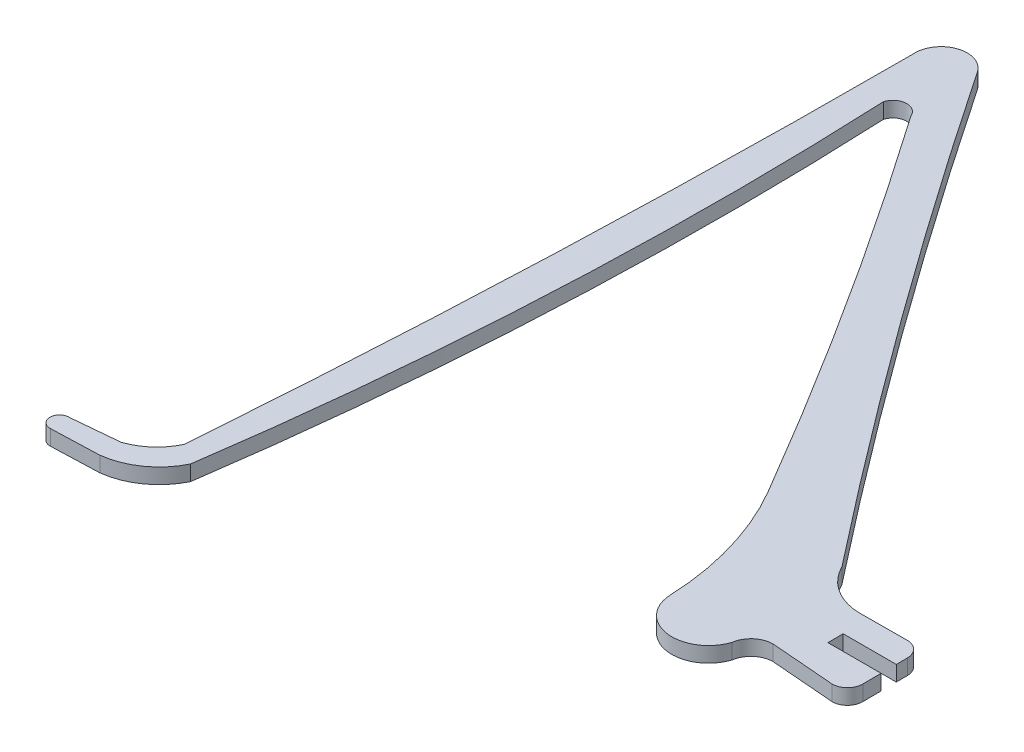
ISO-10303-21;
HEADER;
FILE_DESCRIPTION(('STEP AP214'),'2;1');
FILE_NAME('part.step','',(''),(''),'','','');
FILE_SCHEMA(('AUTOMOTIVE_DESIGN { 1 0 10303 214 1 1 1 1 }'));
ENDSEC;
DATA;
#1=APPLICATION_CONTEXT('core data for automotive mechanical design processes');
#2=APPLICATION_PROTOCOL_DEFINITION('international standard','automotive_design',2000,#1);
#3=PRODUCT_CONTEXT('',#1,'mechanical');
#4=PRODUCT('Part','Part','',(#3));
#5=PRODUCT_RELATED_PRODUCT_CATEGORY('part','',(#4));
#6=PRODUCT_DEFINITION_FORMATION('','',#4);
#7=PRODUCT_DEFINITION_CONTEXT('part definition',#1,'design');
#8=PRODUCT_DEFINITION('design','',#6,#7);
#9=PRODUCT_DEFINITION_SHAPE('','',#8);
#10=(LENGTH_UNIT() NAMED_UNIT(*) SI_UNIT(.MILLI.,.METRE.));
#11=(NAMED_UNIT(*) PLANE_ANGLE_UNIT() SI_UNIT($,.RADIAN.));
#12=(NAMED_UNIT(*) SI_UNIT($,.STERADIAN.) SOLID_ANGLE_UNIT());
#13=UNCERTAINTY_MEASURE_WITH_UNIT(LENGTH_MEASURE(1.E-05),#10,'distance_accuracy_value','');
#14=(GEOMETRIC_REPRESENTATION_CONTEXT(3) GLOBAL_UNCERTAINTY_ASSIGNED_CONTEXT((#13)) GLOBAL_UNIT_ASSIGNED_CONTEXT((#10,
#11,#12)) REPRESENTATION_CONTEXT('',''));
#15=CARTESIAN_POINT('',(0.,0.,0.));
#16=DIRECTION('',(0.,0.,1.));
#17=DIRECTION('',(1.,0.,0.));
#18=AXIS2_PLACEMENT_3D('',#15,#16,#17);
#19=CARTESIAN_POINT('',(-42152.2019871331,3.,-18324.132786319));
#20=DIRECTION('',(0.,-1.,0.));
#21=DIRECTION('',(0.,0.,-1.));
#22=AXIS2_PLACEMENT_3D('',#19,#20,#21);
#23=CYLINDRICAL_SURFACE('',#22,13.2933695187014);
#24=CARTESIAN_POINT('',(-42152.2019871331,0.,-18324.132786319));
#25=DIRECTION('',(0.,1.,0.));
#26=DIRECTION('',(0.,0.,1.));
#27=AXIS2_PLACEMENT_3D('',#24,#25,#26);
#28=CIRCLE('',#27,13.2933695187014);
#29=CARTESIAN_POINT('',(-42150.574219,0.,-18310.939453));
#30=VERTEX_POINT('',#29);
#31=CARTESIAN_POINT('',(-42140.243633,0.,-18318.326631));
#32=VERTEX_POINT('',#31);
#33=EDGE_CURVE('E228',#30,#32,#28,.T.);
#34=ORIENTED_EDGE('',*,*,#33,.T.);
#35=DIRECTION('',(0.,-1.,0.));
#36=VECTOR('',#35,1.);
#37=CARTESIAN_POINT('',(-42140.243633,3.,-18318.326631));
#38=LINE('',#37,#36);
#39=CARTESIAN_POINT('',(-42140.243633,3.,-18318.326631));
#40=VERTEX_POINT('',#39);
#41=EDGE_CURVE('E11',#40,#32,#38,.T.);
#42=ORIENTED_EDGE('',*,*,#41,.F.);
#43=CARTESIAN_POINT('',(-42152.2019871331,3.,-18324.132786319));
#44=DIRECTION('',(0.,1.,0.));
#45=DIRECTION('',(0.,0.,1.));
#46=AXIS2_PLACEMENT_3D('',#43,#44,#45);
#47=CIRCLE('',#46,13.2933695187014);
#48=CARTESIAN_POINT('',(-42150.574219,3.,-18310.939453));
#49=VERTEX_POINT('',#48);
#50=EDGE_CURVE('E274',#49,#40,#47,.T.);
#51=ORIENTED_EDGE('',*,*,#50,.F.);
#52=DIRECTION('',(0.,-1.,0.));
#53=VECTOR('',#52,1.);
#54=CARTESIAN_POINT('',(-42150.574219,3.,-18310.939453));
#55=LINE('',#54,#53);
#56=EDGE_CURVE('E224',#49,#30,#55,.T.);
#57=ORIENTED_EDGE('',*,*,#56,.T.);
#58=EDGE_LOOP('',(#34,#42,#51,#57));
#59=FACE_BOUND('',#58,.T.);
#60=ADVANCED_FACE('F36',(#59),#23,.T.);
#61=CARTESIAN_POINT('',(-42815.5416982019,3.,-18416.5647065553));
#62=DIRECTION('',(0.,-1.,0.));
#63=DIRECTION('',(0.,0.,-1.));
#64=AXIS2_PLACEMENT_3D('',#61,#62,#63);
#65=CYLINDRICAL_SURFACE('',#64,682.406181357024);
#66=CARTESIAN_POINT('',(-42815.5416982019,0.,-18416.5647065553));
#67=DIRECTION('',(0.,1.,0.));
#68=DIRECTION('',(0.,0.,1.));
#69=AXIS2_PLACEMENT_3D('',#66,#67,#68);
#70=CIRCLE('',#69,682.406181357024);
#71=CARTESIAN_POINT('',(-42133.839682,0.,-18447.557568));
#72=VERTEX_POINT('',#71);
#73=EDGE_CURVE('E231',#32,#72,#70,.T.);
#74=ORIENTED_EDGE('',*,*,#73,.T.);
#75=DIRECTION('',(0.,-1.,0.));
#76=VECTOR('',#75,1.);
#77=CARTESIAN_POINT('',(-42133.839682,3.,-18447.557568));
#78=LINE('',#77,#76);
#79=CARTESIAN_POINT('',(-42133.839682,3.,-18447.557568));
#80=VERTEX_POINT('',#79);
#81=EDGE_CURVE('E44',#80,#72,#78,.T.);
#82=ORIENTED_EDGE('',*,*,#81,.F.);
#83=CARTESIAN_POINT('',(-42815.5416982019,3.,-18416.5647065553));
#84=DIRECTION('',(0.,1.,0.));
#85=DIRECTION('',(0.,0.,1.));
#86=AXIS2_PLACEMENT_3D('',#83,#84,#85);
#87=CIRCLE('',#86,682.406181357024);
#88=EDGE_CURVE('E143',#40,#80,#87,.T.);
#89=ORIENTED_EDGE('',*,*,#88,.F.);
#90=ORIENTED_EDGE('',*,*,#41,.T.);
#91=EDGE_LOOP('',(#74,#82,#89,#90));
#92=FACE_BOUND('',#91,.T.);
#93=ADVANCED_FACE('F412',(#92),#65,.T.);
#94=CARTESIAN_POINT('',(-42131.2401209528,3.,-18446.8614757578));
#95=DIRECTION('',(0.,-1.,0.));
#96=DIRECTION('',(0.,0.,-1.));
#97=AXIS2_PLACEMENT_3D('',#94,#95,#96);
#98=CYLINDRICAL_SURFACE('',#97,2.69114511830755);
#99=CARTESIAN_POINT('',(-42131.2401209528,0.,-18446.8614757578));
#100=DIRECTION('',(0.,-1.,0.));
#101=DIRECTION('',(0.,0.,1.));
#102=AXIS2_PLACEMENT_3D('',#99,#100,#101);
#103=CIRCLE('',#102,2.69114511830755);
#104=CARTESIAN_POINT('',(-42128.7660750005,0.,-18447.9204180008));
#105=VERTEX_POINT('',#104);
#106=EDGE_CURVE('E233',#72,#105,#103,.T.);
#107=ORIENTED_EDGE('',*,*,#106,.T.);
#108=DIRECTION('',(0.,-1.,0.));
#109=VECTOR('',#108,1.);
#110=CARTESIAN_POINT('',(-42128.7660750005,3.,-18447.9204180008));
#111=LINE('',#110,#109);
#112=CARTESIAN_POINT('',(-42128.7660750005,3.,-18447.9204180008));
#113=VERTEX_POINT('',#112);
#114=EDGE_CURVE('E329',#113,#105,#111,.T.);
#115=ORIENTED_EDGE('',*,*,#114,.F.);
#116=CARTESIAN_POINT('',(-42131.2401209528,3.,-18446.8614757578));
#117=DIRECTION('',(0.,-1.,0.));
#118=DIRECTION('',(0.,0.,1.));
#119=AXIS2_PLACEMENT_3D('',#116,#117,#118);
#120=CIRCLE('',#119,2.69114511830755);
#121=EDGE_CURVE('E337',#80,#113,#120,.T.);
#122=ORIENTED_EDGE('',*,*,#121,.F.);
#123=ORIENTED_EDGE('',*,*,#81,.T.);
#124=EDGE_LOOP('',(#107,#115,#122,#123));
#125=FACE_BOUND('',#124,.T.);
#126=ADVANCED_FACE('F335',(#125),#98,.F.);
#127=CARTESIAN_POINT('',(-43061.4448435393,3.,-17796.1186435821));
#128=DIRECTION('',(0.,-1.,0.));
#129=DIRECTION('',(0.,0.,-1.));
#130=AXIS2_PLACEMENT_3D('',#127,#128,#129);
#131=CYLINDRICAL_SURFACE('',#130,1137.8643321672);
#132=CARTESIAN_POINT('',(-43061.4448435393,0.,-17796.1186435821));
#133=DIRECTION('',(0.,-1.,0.));
#134=DIRECTION('',(0.,0.,1.));
#135=AXIS2_PLACEMENT_3D('',#132,#133,#134);
#136=CIRCLE('',#135,1137.8643321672);
#137=CARTESIAN_POINT('',(-42079.0087570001,0.,-18370.187084));
#138=VERTEX_POINT('',#137);
#139=EDGE_CURVE('E235',#105,#138,#136,.T.);
#140=ORIENTED_EDGE('',*,*,#139,.T.);
#141=DIRECTION('',(0.,-1.,0.));
#142=VECTOR('',#141,1.);
#143=CARTESIAN_POINT('',(-42079.0087570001,3.,-18370.187084));
#144=LINE('',#143,#142);
#145=CARTESIAN_POINT('',(-42079.0087570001,3.,-18370.187084));
#146=VERTEX_POINT('',#145);
#147=EDGE_CURVE('E326',#146,#138,#144,.T.);
#148=ORIENTED_EDGE('',*,*,#147,.F.);
#149=CARTESIAN_POINT('',(-43061.4448435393,3.,-17796.1186435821));
#150=DIRECTION('',(0.,-1.,0.));
#151=DIRECTION('',(0.,0.,1.));
#152=AXIS2_PLACEMENT_3D('',#149,#150,#151);
#153=CIRCLE('',#152,1137.8643321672);
#154=EDGE_CURVE('E355',#113,#146,#153,.T.);
#155=ORIENTED_EDGE('',*,*,#154,.F.);
#156=ORIENTED_EDGE('',*,*,#114,.T.);
#157=EDGE_LOOP('',(#140,#148,#155,#156));
#158=FACE_BOUND('',#157,.T.);
#159=ADVANCED_FACE('F346',(#158),#131,.F.);
#160=CARTESIAN_POINT('',(-42129.6551655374,3.,-18340.5861490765));
#161=DIRECTION('',(0.,-1.,0.));
#162=DIRECTION('',(0.,0.,-1.));
#163=AXIS2_PLACEMENT_3D('',#160,#161,#162);
#164=CYLINDRICAL_SURFACE('',#163,58.6623733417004);
#165=CARTESIAN_POINT('',(-42129.6551655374,0.,-18340.5861490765));
#166=DIRECTION('',(0.,-1.,0.));
#167=DIRECTION('',(0.,0.,1.));
#168=AXIS2_PLACEMENT_3D('',#165,#166,#167);
#169=CIRCLE('',#168,58.6623733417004);
#170=CARTESIAN_POINT('',(-42071.044649,0.,-18343.052198));
#171=VERTEX_POINT('',#170);
#172=EDGE_CURVE('E237',#138,#171,#169,.T.);
#173=ORIENTED_EDGE('',*,*,#172,.T.);
#174=DIRECTION('',(0.,-1.,0.));
#175=VECTOR('',#174,1.);
#176=CARTESIAN_POINT('',(-42071.044649,3.,-18343.052198));
#177=LINE('',#176,#175);
#178=CARTESIAN_POINT('',(-42071.044649,3.,-18343.052198));
#179=VERTEX_POINT('',#178);
#180=EDGE_CURVE('E323',#179,#171,#177,.T.);
#181=ORIENTED_EDGE('',*,*,#180,.F.);
#182=CARTESIAN_POINT('',(-42129.6551655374,3.,-18340.5861490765));
#183=DIRECTION('',(0.,-1.,0.));
#184=DIRECTION('',(0.,0.,1.));
#185=AXIS2_PLACEMENT_3D('',#182,#183,#184);
#186=CIRCLE('',#185,58.6623733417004);
#187=EDGE_CURVE('E352',#146,#179,#186,.T.);
#188=ORIENTED_EDGE('',*,*,#187,.F.);
#189=ORIENTED_EDGE('',*,*,#147,.T.);
#190=EDGE_LOOP('',(#173,#181,#188,#189));
#191=FACE_BOUND('',#190,.T.);
#192=ADVANCED_FACE('F350',(#191),#164,.F.);
#193=CARTESIAN_POINT('',(-42063.8327879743,3.,-18343.3555760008));
#194=DIRECTION('',(0.,-1.,0.));
#195=DIRECTION('',(0.,0.,-1.));
#196=AXIS2_PLACEMENT_3D('',#193,#194,#195);
#197=CYLINDRICAL_SURFACE('',#196,7.21823923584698);
#198=CARTESIAN_POINT('',(-42063.8327879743,0.,-18343.3555760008));
#199=DIRECTION('',(0.,1.,0.));
#200=DIRECTION('',(0.,0.,1.));
#201=AXIS2_PLACEMENT_3D('',#198,#199,#200);
#202=CIRCLE('',#201,7.21823923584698);
#203=CARTESIAN_POINT('',(-42056.987565,0.,-18341.0651829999));
#204=VERTEX_POINT('',#203);
#205=EDGE_CURVE('E239',#171,#204,#202,.T.);
#206=ORIENTED_EDGE('',*,*,#205,.T.);
#207=DIRECTION('',(0.,-1.,0.));
#208=VECTOR('',#207,1.);
#209=CARTESIAN_POINT('',(-42056.987565,3.,-18341.0651829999));
#210=LINE('',#209,#208);
#211=CARTESIAN_POINT('',(-42056.987565,3.,-18341.0651829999));
#212=VERTEX_POINT('',#211);
#213=EDGE_CURVE('E320',#212,#204,#210,.T.);
#214=ORIENTED_EDGE('',*,*,#213,.F.);
#215=CARTESIAN_POINT('',(-42063.8327879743,3.,-18343.3555760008));
#216=DIRECTION('',(0.,1.,0.));
#217=DIRECTION('',(0.,0.,1.));
#218=AXIS2_PLACEMENT_3D('',#215,#216,#217);
#219=CIRCLE('',#218,7.21823923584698);
#220=EDGE_CURVE('E354',#179,#212,#219,.T.);
#221=ORIENTED_EDGE('',*,*,#220,.F.);
#222=ORIENTED_EDGE('',*,*,#180,.T.);
#223=EDGE_LOOP('',(#206,#214,#221,#222));
#224=FACE_BOUND('',#223,.T.);
#225=ADVANCED_FACE('F425',(#224),#197,.T.);
#226=CARTESIAN_POINT('',(-42052.671817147,3.,-18340.478566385));
#227=DIRECTION('',(0.,-1.,0.));
#228=DIRECTION('',(0.,0.,-1.));
#229=AXIS2_PLACEMENT_3D('',#226,#227,#228);
#230=CYLINDRICAL_SURFACE('',#229,4.35543322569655);
#231=CARTESIAN_POINT('',(-42052.671817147,0.,-18340.478566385));
#232=DIRECTION('',(0.,-1.,0.));
#233=DIRECTION('',(0.,0.,1.));
#234=AXIS2_PLACEMENT_3D('',#231,#232,#233);
#235=CIRCLE('',#234,4.35543322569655);
#236=CARTESIAN_POINT('',(-42052.660156,0.,-18344.833984));
#237=VERTEX_POINT('',#236);
#238=EDGE_CURVE('E241',#204,#237,#235,.T.);
#239=ORIENTED_EDGE('',*,*,#238,.T.);
#240=DIRECTION('',(0.,-1.,0.));
#241=VECTOR('',#240,1.);
#242=CARTESIAN_POINT('',(-42052.660156,3.,-18344.833984));
#243=LINE('',#242,#241);
#244=CARTESIAN_POINT('',(-42052.660156,3.,-18344.833984));
#245=VERTEX_POINT('',#244);
#246=EDGE_CURVE('E317',#245,#237,#243,.T.);
#247=ORIENTED_EDGE('',*,*,#246,.F.);
#248=CARTESIAN_POINT('',(-42052.671817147,3.,-18340.478566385));
#249=DIRECTION('',(0.,-1.,0.));
#250=DIRECTION('',(0.,0.,1.));
#251=AXIS2_PLACEMENT_3D('',#248,#249,#250);
#252=CIRCLE('',#251,4.35543322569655);
#253=EDGE_CURVE('E357',#212,#245,#252,.T.);
#254=ORIENTED_EDGE('',*,*,#253,.F.);
#255=ORIENTED_EDGE('',*,*,#213,.T.);
#256=EDGE_LOOP('',(#239,#247,#254,#255));
#257=FACE_BOUND('',#256,.T.);
#258=ADVANCED_FACE('F428',(#257),#230,.F.);
#259=CARTESIAN_POINT('',(-42040.093369,3.,-18343.8164720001));
#260=DIRECTION('',(0.0807042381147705,0.,-0.996738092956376));
#261=DIRECTION('',(-0.996738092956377,0.,-0.0807042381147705));
#262=AXIS2_PLACEMENT_3D('',#259,#260,#261);
#263=PLANE('',#262);
#264=DIRECTION('',(0.996738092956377,0.,0.0807042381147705));
#265=VECTOR('',#264,1.);
#266=CARTESIAN_POINT('',(-42040.093369,0.,-18343.8164720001));
#267=LINE('',#266,#265);
#268=CARTESIAN_POINT('',(-42040.093369,0.,-18343.8164720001));
#269=VERTEX_POINT('',#268);
#270=EDGE_CURVE('E243',#237,#269,#267,.T.);
#271=ORIENTED_EDGE('',*,*,#270,.T.);
#272=DIRECTION('',(0.,-1.,0.));
#273=VECTOR('',#272,1.);
#274=CARTESIAN_POINT('',(-42040.093369,3.,-18343.8164720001));
#275=LINE('',#274,#273);
#276=CARTESIAN_POINT('',(-42040.093369,3.,-18343.8164720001));
#277=VERTEX_POINT('',#276);
#278=EDGE_CURVE('E314',#277,#269,#275,.T.);
#279=ORIENTED_EDGE('',*,*,#278,.F.);
#280=DIRECTION('',(0.996738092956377,0.,0.0807042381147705));
#281=VECTOR('',#280,1.);
#282=CARTESIAN_POINT('',(-42040.093369,3.,-18343.8164720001));
#283=LINE('',#282,#281);
#284=EDGE_CURVE('E363',#245,#277,#283,.T.);
#285=ORIENTED_EDGE('',*,*,#284,.F.);
#286=ORIENTED_EDGE('',*,*,#246,.T.);
#287=EDGE_LOOP('',(#271,#279,#285,#286));
#288=FACE_BOUND('',#287,.T.);
#289=ADVANCED_FACE('F432',(#288),#263,.F.);
#290=CARTESIAN_POINT('',(-42040.1151884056,3.,-18346.8144708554));
#291=DIRECTION('',(0.,-1.,0.));
#292=DIRECTION('',(0.,0.,-1.));
#293=AXIS2_PLACEMENT_3D('',#290,#291,#292);
#294=CYLINDRICAL_SURFACE('',#293,2.99807825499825);
#295=CARTESIAN_POINT('',(-42040.1151884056,0.,-18346.8144708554));
#296=DIRECTION('',(0.,1.,0.));
#297=DIRECTION('',(0.,0.,1.));
#298=AXIS2_PLACEMENT_3D('',#295,#296,#297);
#299=CIRCLE('',#298,2.99807825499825);
#300=CARTESIAN_POINT('',(-42037.117187,0.,-18346.835937));
#301=VERTEX_POINT('',#300);
#302=EDGE_CURVE('E245',#269,#301,#299,.T.);
#303=ORIENTED_EDGE('',*,*,#302,.T.);
#304=DIRECTION('',(0.,-1.,0.));
#305=VECTOR('',#304,1.);
#306=CARTESIAN_POINT('',(-42037.117187,3.,-18346.835937));
#307=LINE('',#306,#305);
#308=CARTESIAN_POINT('',(-42037.117187,3.,-18346.835937));
#309=VERTEX_POINT('',#308);
#310=EDGE_CURVE('E311',#309,#301,#307,.T.);
#311=ORIENTED_EDGE('',*,*,#310,.F.);
#312=CARTESIAN_POINT('',(-42040.1151884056,3.,-18346.8144708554));
#313=DIRECTION('',(0.,1.,0.));
#314=DIRECTION('',(0.,0.,1.));
#315=AXIS2_PLACEMENT_3D('',#312,#313,#314);
#316=CIRCLE('',#315,2.99807825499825);
#317=EDGE_CURVE('E365',#277,#309,#316,.T.);
#318=ORIENTED_EDGE('',*,*,#317,.F.);
#319=ORIENTED_EDGE('',*,*,#278,.T.);
#320=EDGE_LOOP('',(#303,#311,#318,#319));
#321=FACE_BOUND('',#320,.T.);
#322=ADVANCED_FACE('F436',(#321),#294,.T.);
#323=CARTESIAN_POINT('',(-42037.140625,3.,-18350.431641));
#324=DIRECTION('',(-0.999978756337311,0.,0.00651819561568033));
#325=DIRECTION('',(0.00651819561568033,0.,0.999978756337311));
#326=AXIS2_PLACEMENT_3D('',#323,#324,#325);
#327=PLANE('',#326);
#328=DIRECTION('',(-0.00651819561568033,0.,-0.999978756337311));
#329=VECTOR('',#328,1.);
#330=CARTESIAN_POINT('',(-42037.140625,0.,-18350.431641));
#331=LINE('',#330,#329);
#332=CARTESIAN_POINT('',(-42037.140625,0.,-18350.431641));
#333=VERTEX_POINT('',#332);
#334=EDGE_CURVE('E247',#301,#333,#331,.T.);
#335=ORIENTED_EDGE('',*,*,#334,.T.);
#336=DIRECTION('',(0.,-1.,0.));
#337=VECTOR('',#336,1.);
#338=CARTESIAN_POINT('',(-42037.140625,3.,-18350.431641));
#339=LINE('',#338,#337);
#340=CARTESIAN_POINT('',(-42037.140625,3.,-18350.431641));
#341=VERTEX_POINT('',#340);
#342=EDGE_CURVE('E308',#341,#333,#339,.T.);
#343=ORIENTED_EDGE('',*,*,#342,.F.);
#344=DIRECTION('',(-0.00651819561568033,0.,-0.999978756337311));
#345=VECTOR('',#344,1.);
#346=CARTESIAN_POINT('',(-42037.140625,3.,-18350.431641));
#347=LINE('',#346,#345);
#348=EDGE_CURVE('E367',#309,#341,#347,.T.);
#349=ORIENTED_EDGE('',*,*,#348,.F.);
#350=ORIENTED_EDGE('',*,*,#310,.T.);
#351=EDGE_LOOP('',(#335,#343,#349,#350));
#352=FACE_BOUND('',#351,.T.);
#353=ADVANCED_FACE('F440',(#352),#327,.F.);
#354=CARTESIAN_POINT('',(-42047.542969,3.,-18350.429687));
#355=DIRECTION('',(0.000187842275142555,0.,0.99999998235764));
#356=DIRECTION('',(0.99999998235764,0.,-0.000187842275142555));
#357=AXIS2_PLACEMENT_3D('',#354,#355,#356);
#358=PLANE('',#357);
#359=DIRECTION('',(-0.99999998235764,0.,0.000187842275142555));
#360=VECTOR('',#359,1.);
#361=CARTESIAN_POINT('',(-42047.542969,0.,-18350.429687));
#362=LINE('',#361,#360);
#363=CARTESIAN_POINT('',(-42047.542969,0.,-18350.429687));
#364=VERTEX_POINT('',#363);
#365=EDGE_CURVE('E249',#333,#364,#362,.T.);
#366=ORIENTED_EDGE('',*,*,#365,.T.);
#367=DIRECTION('',(0.,-1.,0.));
#368=VECTOR('',#367,1.);
#369=CARTESIAN_POINT('',(-42047.542969,3.,-18350.429687));
#370=LINE('',#369,#368);
#371=CARTESIAN_POINT('',(-42047.542969,3.,-18350.429687));
#372=VERTEX_POINT('',#371);
#373=EDGE_CURVE('E305',#372,#364,#370,.T.);
#374=ORIENTED_EDGE('',*,*,#373,.F.);
#375=DIRECTION('',(-0.99999998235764,0.,0.000187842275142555));
#376=VECTOR('',#375,1.);
#377=CARTESIAN_POINT('',(-42047.542969,3.,-18350.429687));
#378=LINE('',#377,#376);
#379=EDGE_CURVE('E369',#341,#372,#378,.T.);
#380=ORIENTED_EDGE('',*,*,#379,.F.);
#381=ORIENTED_EDGE('',*,*,#342,.T.);
#382=EDGE_LOOP('',(#366,#374,#380,#381));
#383=FACE_BOUND('',#382,.T.);
#384=ADVANCED_FACE('F444',(#383),#358,.F.);
#385=CARTESIAN_POINT('',(-42047.566406,3.,-18353.429687));
#386=DIRECTION('',(-0.999969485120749,0.,0.00781209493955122));
#387=DIRECTION('',(0.00781209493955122,0.,0.999969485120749));
#388=AXIS2_PLACEMENT_3D('',#385,#386,#387);
#389=PLANE('',#388);
#390=DIRECTION('',(-0.00781209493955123,0.,-0.999969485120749));
#391=VECTOR('',#390,1.);
#392=CARTESIAN_POINT('',(-42047.566406,0.,-18353.429687));
#393=LINE('',#392,#391);
#394=CARTESIAN_POINT('',(-42047.566406,0.,-18353.429687));
#395=VERTEX_POINT('',#394);
#396=EDGE_CURVE('E251',#364,#395,#393,.T.);
#397=ORIENTED_EDGE('',*,*,#396,.T.);
#398=DIRECTION('',(0.,-1.,0.));
#399=VECTOR('',#398,1.);
#400=CARTESIAN_POINT('',(-42047.566406,3.,-18353.429687));
#401=LINE('',#400,#399);
#402=CARTESIAN_POINT('',(-42047.566406,3.,-18353.429687));
#403=VERTEX_POINT('',#402);
#404=EDGE_CURVE('E302',#403,#395,#401,.T.);
#405=ORIENTED_EDGE('',*,*,#404,.F.);
#406=DIRECTION('',(-0.00781209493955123,0.,-0.999969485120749));
#407=VECTOR('',#406,1.);
#408=CARTESIAN_POINT('',(-42047.566406,3.,-18353.429687));
#409=LINE('',#408,#407);
#410=EDGE_CURVE('E371',#372,#403,#409,.T.);
#411=ORIENTED_EDGE('',*,*,#410,.F.);
#412=ORIENTED_EDGE('',*,*,#373,.T.);
#413=EDGE_LOOP('',(#397,#405,#411,#412));
#414=FACE_BOUND('',#413,.T.);
#415=ADVANCED_FACE('F448',(#414),#389,.F.);
#416=CARTESIAN_POINT('',(-42037.160156,3.,-18353.429687));
#417=DIRECTION('',(0.,0.,-1.));
#418=DIRECTION('',(-1.,0.,0.));
#419=AXIS2_PLACEMENT_3D('',#416,#417,#418);
#420=PLANE('',#419);
#421=DIRECTION('',(1.,0.,0.));
#422=VECTOR('',#421,1.);
#423=CARTESIAN_POINT('',(-42037.160156,0.,-18353.429687));
#424=LINE('',#423,#422);
#425=CARTESIAN_POINT('',(-42037.160156,0.,-18353.429687));
#426=VERTEX_POINT('',#425);
#427=EDGE_CURVE('E253',#395,#426,#424,.T.);
#428=ORIENTED_EDGE('',*,*,#427,.T.);
#429=DIRECTION('',(0.,-1.,0.));
#430=VECTOR('',#429,1.);
#431=CARTESIAN_POINT('',(-42037.160156,3.,-18353.429687));
#432=LINE('',#431,#430);
#433=CARTESIAN_POINT('',(-42037.160156,3.,-18353.429687));
#434=VERTEX_POINT('',#433);
#435=EDGE_CURVE('E299',#434,#426,#432,.T.);
#436=ORIENTED_EDGE('',*,*,#435,.F.);
#437=DIRECTION('',(1.,0.,0.));
#438=VECTOR('',#437,1.);
#439=CARTESIAN_POINT('',(-42037.160156,3.,-18353.429687));
#440=LINE('',#439,#438);
#441=EDGE_CURVE('E373',#403,#434,#440,.T.);
#442=ORIENTED_EDGE('',*,*,#441,.F.);
#443=ORIENTED_EDGE('',*,*,#404,.T.);
#444=EDGE_LOOP('',(#428,#436,#442,#443));
#445=FACE_BOUND('',#444,.T.);
#446=ADVANCED_FACE('F452',(#445),#420,.F.);
#447=CARTESIAN_POINT('',(-42037.171934,3.,-18355.612608));
#448=DIRECTION('',(-0.999985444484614,0.,0.00539544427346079));
#449=DIRECTION('',(0.00539544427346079,0.,0.999985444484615));
#450=AXIS2_PLACEMENT_3D('',#447,#448,#449);
#451=PLANE('',#450);
#452=DIRECTION('',(-0.00539544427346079,0.,-0.999985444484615));
#453=VECTOR('',#452,1.);
#454=CARTESIAN_POINT('',(-42037.171934,0.,-18355.612608));
#455=LINE('',#454,#453);
#456=CARTESIAN_POINT('',(-42037.171934,0.,-18355.612608));
#457=VERTEX_POINT('',#456);
#458=EDGE_CURVE('E255',#426,#457,#455,.T.);
#459=ORIENTED_EDGE('',*,*,#458,.T.);
#460=DIRECTION('',(0.,-1.,0.));
#461=VECTOR('',#460,1.);
#462=CARTESIAN_POINT('',(-42037.171934,3.,-18355.612608));
#463=LINE('',#462,#461);
#464=CARTESIAN_POINT('',(-42037.171934,3.,-18355.612608));
#465=VERTEX_POINT('',#464);
#466=EDGE_CURVE('E296',#465,#457,#463,.T.);
#467=ORIENTED_EDGE('',*,*,#466,.F.);
#468=DIRECTION('',(-0.00539544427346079,0.,-0.999985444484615));
#469=VECTOR('',#468,1.);
#470=CARTESIAN_POINT('',(-42037.171934,3.,-18355.612608));
#471=LINE('',#470,#469);
#472=EDGE_CURVE('E375',#434,#465,#471,.T.);
#473=ORIENTED_EDGE('',*,*,#472,.F.);
#474=ORIENTED_EDGE('',*,*,#435,.T.);
#475=EDGE_LOOP('',(#459,#467,#473,#474));
#476=FACE_BOUND('',#475,.T.);
#477=ADVANCED_FACE('F456',(#476),#451,.F.);
#478=CARTESIAN_POINT('',(-42040.1738707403,3.,-18355.5957229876));
#479=DIRECTION('',(0.,-1.,0.));
#480=DIRECTION('',(0.,0.,-1.));
#481=AXIS2_PLACEMENT_3D('',#478,#479,#480);
#482=CYLINDRICAL_SURFACE('',#481,3.00198422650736);
#483=CARTESIAN_POINT('',(-42040.1738707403,0.,-18355.5957229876));
#484=DIRECTION('',(0.,1.,0.));
#485=DIRECTION('',(0.,0.,1.));
#486=AXIS2_PLACEMENT_3D('',#483,#484,#485);
#487=CIRCLE('',#486,3.00198422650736);
#488=CARTESIAN_POINT('',(-42040.191406,0.,-18358.597656));
#489=VERTEX_POINT('',#488);
#490=EDGE_CURVE('E257',#457,#489,#487,.T.);
#491=ORIENTED_EDGE('',*,*,#490,.T.);
#492=DIRECTION('',(0.,-1.,0.));
#493=VECTOR('',#492,1.);
#494=CARTESIAN_POINT('',(-42040.191406,3.,-18358.597656));
#495=LINE('',#494,#493);
#496=CARTESIAN_POINT('',(-42040.191406,3.,-18358.597656));
#497=VERTEX_POINT('',#496);
#498=EDGE_CURVE('E293',#497,#489,#495,.T.);
#499=ORIENTED_EDGE('',*,*,#498,.F.);
#500=CARTESIAN_POINT('',(-42040.1738707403,3.,-18355.5957229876));
#501=DIRECTION('',(0.,1.,0.));
#502=DIRECTION('',(0.,0.,1.));
#503=AXIS2_PLACEMENT_3D('',#500,#501,#502);
#504=CIRCLE('',#503,3.00198422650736);
#505=EDGE_CURVE('E377',#465,#497,#504,.T.);
#506=ORIENTED_EDGE('',*,*,#505,.F.);
#507=ORIENTED_EDGE('',*,*,#466,.T.);
#508=EDGE_LOOP('',(#491,#499,#506,#507));
#509=FACE_BOUND('',#508,.T.);
#510=ADVANCED_FACE('F460',(#509),#482,.T.);
#511=CARTESIAN_POINT('',(-42049.491433,3.,-18358.539661));
#512=DIRECTION('',(0.00623588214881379,0.,0.999980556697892));
#513=DIRECTION('',(0.999980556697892,0.,-0.00623588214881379));
#514=AXIS2_PLACEMENT_3D('',#511,#512,#513);
#515=PLANE('',#514);
#516=DIRECTION('',(-0.999980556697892,0.,0.00623588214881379));
#517=VECTOR('',#516,1.);
#518=CARTESIAN_POINT('',(-42049.491433,0.,-18358.539661));
#519=LINE('',#518,#517);
#520=CARTESIAN_POINT('',(-42049.491433,0.,-18358.539661));
#521=VERTEX_POINT('',#520);
#522=EDGE_CURVE('E259',#489,#521,#519,.T.);
#523=ORIENTED_EDGE('',*,*,#522,.T.);
#524=DIRECTION('',(0.,-1.,0.));
#525=VECTOR('',#524,1.);
#526=CARTESIAN_POINT('',(-42049.491433,3.,-18358.539661));
#527=LINE('',#526,#525);
#528=CARTESIAN_POINT('',(-42049.491433,3.,-18358.539661));
#529=VERTEX_POINT('',#528);
#530=EDGE_CURVE('E290',#529,#521,#527,.T.);
#531=ORIENTED_EDGE('',*,*,#530,.F.);
#532=DIRECTION('',(-0.999980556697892,0.,0.00623588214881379));
#533=VECTOR('',#532,1.);
#534=CARTESIAN_POINT('',(-42049.491433,3.,-18358.539661));
#535=LINE('',#534,#533);
#536=EDGE_CURVE('E379',#497,#529,#535,.T.);
#537=ORIENTED_EDGE('',*,*,#536,.F.);
#538=ORIENTED_EDGE('',*,*,#498,.T.);
#539=EDGE_LOOP('',(#523,#531,#537,#538));
#540=FACE_BOUND('',#539,.T.);
#541=ADVANCED_FACE('F464',(#540),#515,.F.);
#542=CARTESIAN_POINT('',(-42049.2636222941,3.,-18369.3937970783));
#543=DIRECTION('',(0.,-1.,0.));
#544=DIRECTION('',(0.,0.,-1.));
#545=AXIS2_PLACEMENT_3D('',#542,#543,#544);
#546=CYLINDRICAL_SURFACE('',#545,10.8565265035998);
#547=CARTESIAN_POINT('',(-42049.2636222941,0.,-18369.3937970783));
#548=DIRECTION('',(0.,-1.,0.));
#549=DIRECTION('',(0.,0.,1.));
#550=AXIS2_PLACEMENT_3D('',#547,#548,#549);
#551=CIRCLE('',#550,10.8565265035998);
#552=CARTESIAN_POINT('',(-42059.0278360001,0.,-18364.6478200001));
#553=VERTEX_POINT('',#552);
#554=EDGE_CURVE('E261',#521,#553,#551,.T.);
#555=ORIENTED_EDGE('',*,*,#554,.T.);
#556=DIRECTION('',(0.,-1.,0.));
#557=VECTOR('',#556,1.);
#558=CARTESIAN_POINT('',(-42059.0278360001,3.,-18364.6478200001));
#559=LINE('',#558,#557);
#560=CARTESIAN_POINT('',(-42059.0278360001,3.,-18364.6478200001));
#561=VERTEX_POINT('',#560);
#562=EDGE_CURVE('E287',#561,#553,#559,.T.);
#563=ORIENTED_EDGE('',*,*,#562,.F.);
#564=CARTESIAN_POINT('',(-42049.2636222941,3.,-18369.3937970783));
#565=DIRECTION('',(0.,-1.,0.));
#566=DIRECTION('',(0.,0.,1.));
#567=AXIS2_PLACEMENT_3D('',#564,#565,#566);
#568=CIRCLE('',#567,10.8565265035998);
#569=EDGE_CURVE('E381',#529,#561,#568,.T.);
#570=ORIENTED_EDGE('',*,*,#569,.F.);
#571=ORIENTED_EDGE('',*,*,#530,.T.);
#572=EDGE_LOOP('',(#555,#563,#570,#571));
#573=FACE_BOUND('',#572,.T.);
#574=ADVANCED_FACE('F468',(#573),#546,.F.);
#575=CARTESIAN_POINT('',(-40797.9447473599,3.,-19355.7711935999));
#576=DIRECTION('',(0.,-1.,0.));
#577=DIRECTION('',(0.,0.,-1.));
#578=AXIS2_PLACEMENT_3D('',#575,#576,#577);
#579=CYLINDRICAL_SURFACE('',#578,1603.9501545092);
#580=CARTESIAN_POINT('',(-40797.9447473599,0.,-19355.7711935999));
#581=DIRECTION('',(0.,-1.,0.));
#582=DIRECTION('',(0.,0.,1.));
#583=AXIS2_PLACEMENT_3D('',#580,#581,#582);
#584=CIRCLE('',#583,1603.9501545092);
#585=CARTESIAN_POINT('',(-42129.663375,0.,-18461.801622));
#586=VERTEX_POINT('',#585);
#587=EDGE_CURVE('E263',#553,#586,#584,.T.);
#588=ORIENTED_EDGE('',*,*,#587,.T.);
#589=DIRECTION('',(0.,-1.,0.));
#590=VECTOR('',#589,1.);
#591=CARTESIAN_POINT('',(-42129.663375,3.,-18461.801622));
#592=LINE('',#591,#590);
#593=CARTESIAN_POINT('',(-42129.663375,3.,-18461.801622));
#594=VERTEX_POINT('',#593);
#595=EDGE_CURVE('E284',#594,#586,#592,.T.);
#596=ORIENTED_EDGE('',*,*,#595,.F.);
#597=CARTESIAN_POINT('',(-40797.9447473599,3.,-19355.7711935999));
#598=DIRECTION('',(0.,-1.,0.));
#599=DIRECTION('',(0.,0.,1.));
#600=AXIS2_PLACEMENT_3D('',#597,#598,#599);
#601=CIRCLE('',#600,1603.9501545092);
#602=EDGE_CURVE('E383',#561,#594,#601,.T.);
#603=ORIENTED_EDGE('',*,*,#602,.F.);
#604=ORIENTED_EDGE('',*,*,#562,.T.);
#605=EDGE_LOOP('',(#588,#596,#603,#604));
#606=FACE_BOUND('',#605,.T.);
#607=ADVANCED_FACE('F472',(#606),#579,.F.);
#608=CARTESIAN_POINT('',(-42133.9151477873,3.,-18458.9488362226));
#609=DIRECTION('',(0.,-1.,0.));
#610=DIRECTION('',(0.,0.,-1.));
#611=AXIS2_PLACEMENT_3D('',#608,#609,#610);
#612=CYLINDRICAL_SURFACE('',#611,5.12015219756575);
#613=CARTESIAN_POINT('',(-42133.9151477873,0.,-18458.9488362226));
#614=DIRECTION('',(0.,1.,0.));
#615=DIRECTION('',(0.,0.,1.));
#616=AXIS2_PLACEMENT_3D('',#613,#614,#615);
#617=CIRCLE('',#616,5.12015219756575);
#618=CARTESIAN_POINT('',(-42139.015984,0.,-18458.5045070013));
#619=VERTEX_POINT('',#618);
#620=EDGE_CURVE('E265',#586,#619,#617,.T.);
#621=ORIENTED_EDGE('',*,*,#620,.T.);
#622=DIRECTION('',(0.,-1.,0.));
#623=VECTOR('',#622,1.);
#624=CARTESIAN_POINT('',(-42139.015984,3.,-18458.5045070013));
#625=LINE('',#624,#623);
#626=CARTESIAN_POINT('',(-42139.015984,3.,-18458.5045070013));
#627=VERTEX_POINT('',#626);
#628=EDGE_CURVE('E281',#627,#619,#625,.T.);
#629=ORIENTED_EDGE('',*,*,#628,.F.);
#630=CARTESIAN_POINT('',(-42133.9151477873,3.,-18458.9488362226));
#631=DIRECTION('',(0.,1.,0.));
#632=DIRECTION('',(0.,0.,1.));
#633=AXIS2_PLACEMENT_3D('',#630,#631,#632);
#634=CIRCLE('',#633,5.12015219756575);
#635=EDGE_CURVE('E385',#594,#627,#634,.T.);
#636=ORIENTED_EDGE('',*,*,#635,.F.);
#637=ORIENTED_EDGE('',*,*,#595,.T.);
#638=EDGE_LOOP('',(#621,#629,#636,#637));
#639=FACE_BOUND('',#638,.T.);
#640=ADVANCED_FACE('F476',(#639),#612,.T.);
#641=CARTESIAN_POINT('',(-43909.458271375,3.,-18456.1994123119));
#642=DIRECTION('',(0.,-1.,0.));
#643=DIRECTION('',(0.,0.,-1.));
#644=AXIS2_PLACEMENT_3D('',#641,#642,#643);
#645=CYLINDRICAL_SURFACE('',#644,1770.4437879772);
#646=CARTESIAN_POINT('',(-43909.458271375,0.,-18456.1994123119));
#647=DIRECTION('',(0.,-1.,0.));
#648=DIRECTION('',(0.,0.,1.));
#649=AXIS2_PLACEMENT_3D('',#646,#647,#648);
#650=CIRCLE('',#649,1770.4437879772);
#651=CARTESIAN_POINT('',(-42144.18154,0.,-18321.035556));
#652=VERTEX_POINT('',#651);
#653=EDGE_CURVE('E267',#619,#652,#650,.T.);
#654=ORIENTED_EDGE('',*,*,#653,.T.);
#655=DIRECTION('',(0.,-1.,0.));
#656=VECTOR('',#655,1.);
#657=CARTESIAN_POINT('',(-42144.18154,3.,-18321.035556));
#658=LINE('',#657,#656);
#659=CARTESIAN_POINT('',(-42144.18154,3.,-18321.035556));
#660=VERTEX_POINT('',#659);
#661=EDGE_CURVE('E278',#660,#652,#658,.T.);
#662=ORIENTED_EDGE('',*,*,#661,.F.);
#663=CARTESIAN_POINT('',(-43909.458271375,3.,-18456.1994123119));
#664=DIRECTION('',(0.,-1.,0.));
#665=DIRECTION('',(0.,0.,1.));
#666=AXIS2_PLACEMENT_3D('',#663,#664,#665);
#667=CIRCLE('',#666,1770.4437879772);
#668=EDGE_CURVE('E387',#627,#660,#667,.T.);
#669=ORIENTED_EDGE('',*,*,#668,.F.);
#670=ORIENTED_EDGE('',*,*,#628,.T.);
#671=EDGE_LOOP('',(#654,#662,#669,#670));
#672=FACE_BOUND('',#671,.T.);
#673=ADVANCED_FACE('F393',(#672),#645,.F.);
#674=CARTESIAN_POINT('',(-42154.3243413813,3.,-18325.8421180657));
#675=DIRECTION('',(0.,-1.,0.));
#676=DIRECTION('',(0.,0.,-1.));
#677=AXIS2_PLACEMENT_3D('',#674,#675,#676);
#678=CYLINDRICAL_SURFACE('',#677,11.2240571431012);
#679=CARTESIAN_POINT('',(-42154.3243413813,0.,-18325.8421180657));
#680=DIRECTION('',(0.,-1.,0.));
#681=DIRECTION('',(0.,0.,1.));
#682=AXIS2_PLACEMENT_3D('',#679,#680,#681);
#683=CIRCLE('',#682,11.2240571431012);
#684=CARTESIAN_POINT('',(-42150.730469,0.,-18315.208984));
#685=VERTEX_POINT('',#684);
#686=EDGE_CURVE('E269',#652,#685,#683,.T.);
#687=ORIENTED_EDGE('',*,*,#686,.T.);
#688=DIRECTION('',(0.,-1.,0.));
#689=VECTOR('',#688,1.);
#690=CARTESIAN_POINT('',(-42150.730469,3.,-18315.208984));
#691=LINE('',#690,#689);
#692=CARTESIAN_POINT('',(-42150.730469,3.,-18315.208984));
#693=VERTEX_POINT('',#692);
#694=EDGE_CURVE('E219',#693,#685,#691,.T.);
#695=ORIENTED_EDGE('',*,*,#694,.F.);
#696=CARTESIAN_POINT('',(-42154.3243413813,3.,-18325.8421180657));
#697=DIRECTION('',(0.,-1.,0.));
#698=DIRECTION('',(0.,0.,1.));
#699=AXIS2_PLACEMENT_3D('',#696,#697,#698);
#700=CIRCLE('',#699,11.2240571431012);
#701=EDGE_CURVE('E210',#660,#693,#700,.T.);
#702=ORIENTED_EDGE('',*,*,#701,.F.);
#703=ORIENTED_EDGE('',*,*,#661,.T.);
#704=EDGE_LOOP('',(#687,#695,#702,#703));
#705=FACE_BOUND('',#704,.T.);
#706=ADVANCED_FACE('F397',(#705),#678,.F.);
#707=CARTESIAN_POINT('',(-42159.900199,3.,-18314.362715));
#708=DIRECTION('',(0.0918988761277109,0.,0.995768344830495));
#709=DIRECTION('',(0.995768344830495,0.,-0.0918988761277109));
#710=AXIS2_PLACEMENT_3D('',#707,#708,#709);
#711=PLANE('',#710);
#712=DIRECTION('',(-0.995768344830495,0.,0.0918988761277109));
#713=VECTOR('',#712,1.);
#714=CARTESIAN_POINT('',(-42159.900199,0.,-18314.362715));
#715=LINE('',#714,#713);
#716=CARTESIAN_POINT('',(-42159.900199,0.,-18314.362715));
#717=VERTEX_POINT('',#716);
#718=EDGE_CURVE('E218',#685,#717,#715,.T.);
#719=ORIENTED_EDGE('',*,*,#718,.T.);
#720=DIRECTION('',(0.,-1.,0.));
#721=VECTOR('',#720,1.);
#722=CARTESIAN_POINT('',(-42159.900199,3.,-18314.362715));
#723=LINE('',#722,#721);
#724=CARTESIAN_POINT('',(-42159.900199,3.,-18314.362715));
#725=VERTEX_POINT('',#724);
#726=EDGE_CURVE('E215',#725,#717,#723,.T.);
#727=ORIENTED_EDGE('',*,*,#726,.F.);
#728=DIRECTION('',(-0.995768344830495,0.,0.0918988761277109));
#729=VECTOR('',#728,1.);
#730=CARTESIAN_POINT('',(-42159.900199,3.,-18314.362715));
#731=LINE('',#730,#729);
#732=EDGE_CURVE('E204',#693,#725,#731,.T.);
#733=ORIENTED_EDGE('',*,*,#732,.F.);
#734=ORIENTED_EDGE('',*,*,#694,.T.);
#735=EDGE_LOOP('',(#719,#727,#733,#734));
#736=FACE_BOUND('',#735,.T.);
#737=ADVANCED_FACE('F216',(#736),#711,.F.);
#738=CARTESIAN_POINT('',(-42160.0547244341,3.,-18312.4905935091));
#739=DIRECTION('',(0.,-1.,0.));
#740=DIRECTION('',(0.,0.,-1.));
#741=AXIS2_PLACEMENT_3D('',#738,#739,#740);
#742=CYLINDRICAL_SURFACE('',#741,1.87848795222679);
#743=CARTESIAN_POINT('',(-42160.0547244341,0.,-18312.4905935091));
#744=DIRECTION('',(0.,1.,0.));
#745=DIRECTION('',(0.,0.,1.));
#746=AXIS2_PLACEMENT_3D('',#743,#744,#745);
#747=CIRCLE('',#746,1.87848795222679);
#748=CARTESIAN_POINT('',(-42159.988281,0.,-18310.613281));
#749=VERTEX_POINT('',#748);
#750=EDGE_CURVE('E129',#717,#749,#747,.T.);
#751=ORIENTED_EDGE('',*,*,#750,.T.);
#752=DIRECTION('',(0.,-1.,0.));
#753=VECTOR('',#752,1.);
#754=CARTESIAN_POINT('',(-42159.988281,3.,-18310.613281));
#755=LINE('',#754,#753);
#756=CARTESIAN_POINT('',(-42159.988281,3.,-18310.613281));
#757=VERTEX_POINT('',#756);
#758=EDGE_CURVE('E220',#757,#749,#755,.T.);
#759=ORIENTED_EDGE('',*,*,#758,.F.);
#760=CARTESIAN_POINT('',(-42160.0547244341,3.,-18312.4905935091));
#761=DIRECTION('',(0.,1.,0.));
#762=DIRECTION('',(0.,0.,1.));
#763=AXIS2_PLACEMENT_3D('',#760,#761,#762);
#764=CIRCLE('',#763,1.87848795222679);
#765=EDGE_CURVE('E208',#725,#757,#764,.T.);
#766=ORIENTED_EDGE('',*,*,#765,.F.);
#767=ORIENTED_EDGE('',*,*,#726,.T.);
#768=EDGE_LOOP('',(#751,#759,#766,#767));
#769=FACE_BOUND('',#768,.T.);
#770=ADVANCED_FACE('F222',(#769),#742,.T.);
#771=CARTESIAN_POINT('',(-42150.574219,3.,-18310.939453));
#772=DIRECTION('',(-0.0346265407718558,0.,-0.999400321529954));
#773=DIRECTION('',(-0.999400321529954,0.,0.0346265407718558));
#774=AXIS2_PLACEMENT_3D('',#771,#772,#773);
#775=PLANE('',#774);
#776=DIRECTION('',(0.999400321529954,0.,-0.0346265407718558));
#777=VECTOR('',#776,1.);
#778=CARTESIAN_POINT('',(-42150.574219,0.,-18310.939453));
#779=LINE('',#778,#777);
#780=EDGE_CURVE('E135',#749,#30,#779,.T.);
#781=ORIENTED_EDGE('',*,*,#780,.T.);
#782=ORIENTED_EDGE('',*,*,#56,.F.);
#783=DIRECTION('',(0.999400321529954,0.,-0.0346265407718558));
#784=VECTOR('',#783,1.);
#785=CARTESIAN_POINT('',(-42150.574219,3.,-18310.939453));
#786=LINE('',#785,#784);
#787=EDGE_CURVE('E52',#757,#49,#786,.T.);
#788=ORIENTED_EDGE('',*,*,#787,.F.);
#789=ORIENTED_EDGE('',*,*,#758,.T.);
#790=EDGE_LOOP('',(#781,#782,#788,#789));
#791=FACE_BOUND('',#790,.T.);
#792=ADVANCED_FACE('F401',(#791),#775,.F.);
#793=CARTESIAN_POINT('',(-42152.2019871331,3.,-18324.132786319));
#794=DIRECTION('',(0.,1.,0.));
#795=DIRECTION('',(0.,0.,1.));
#796=AXIS2_PLACEMENT_3D('',#793,#794,#795);
#797=PLANE('',#796);
#798=ORIENTED_EDGE('',*,*,#50,.T.);
#799=ORIENTED_EDGE('',*,*,#88,.T.);
#800=ORIENTED_EDGE('',*,*,#121,.T.);
#801=ORIENTED_EDGE('',*,*,#154,.T.);
#802=ORIENTED_EDGE('',*,*,#187,.T.);
#803=ORIENTED_EDGE('',*,*,#220,.T.);
#804=ORIENTED_EDGE('',*,*,#253,.T.);
#805=ORIENTED_EDGE('',*,*,#284,.T.);
#806=ORIENTED_EDGE('',*,*,#317,.T.);
#807=ORIENTED_EDGE('',*,*,#348,.T.);
#808=ORIENTED_EDGE('',*,*,#379,.T.);
#809=ORIENTED_EDGE('',*,*,#410,.T.);
#810=ORIENTED_EDGE('',*,*,#441,.T.);
#811=ORIENTED_EDGE('',*,*,#472,.T.);
#812=ORIENTED_EDGE('',*,*,#505,.T.);
#813=ORIENTED_EDGE('',*,*,#536,.T.);
#814=ORIENTED_EDGE('',*,*,#569,.T.);
#815=ORIENTED_EDGE('',*,*,#602,.T.);
#816=ORIENTED_EDGE('',*,*,#635,.T.);
#817=ORIENTED_EDGE('',*,*,#668,.T.);
#818=ORIENTED_EDGE('',*,*,#701,.T.);
#819=ORIENTED_EDGE('',*,*,#732,.T.);
#820=ORIENTED_EDGE('',*,*,#765,.T.);
#821=ORIENTED_EDGE('',*,*,#787,.T.);
#822=EDGE_LOOP('',(#798,#799,#800,#801,#802,#803,#804,#805,#806,#807,#808,#809,#810,#811,#812,
#813,#814,#815,#816,#817,#818,#819,#820,#821));
#823=FACE_BOUND('',#822,.T.);
#824=ADVANCED_FACE('F206',(#823),#797,.T.);
#825=CARTESIAN_POINT('',(-42152.2019871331,0.,-18324.132786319));
#826=DIRECTION('',(0.,1.,0.));
#827=DIRECTION('',(0.,0.,1.));
#828=AXIS2_PLACEMENT_3D('',#825,#826,#827);
#829=PLANE('',#828);
#830=ORIENTED_EDGE('',*,*,#33,.F.);
#831=ORIENTED_EDGE('',*,*,#780,.F.);
#832=ORIENTED_EDGE('',*,*,#750,.F.);
#833=ORIENTED_EDGE('',*,*,#718,.F.);
#834=ORIENTED_EDGE('',*,*,#686,.F.);
#835=ORIENTED_EDGE('',*,*,#653,.F.);
#836=ORIENTED_EDGE('',*,*,#620,.F.);
#837=ORIENTED_EDGE('',*,*,#587,.F.);
#838=ORIENTED_EDGE('',*,*,#554,.F.);
#839=ORIENTED_EDGE('',*,*,#522,.F.);
#840=ORIENTED_EDGE('',*,*,#490,.F.);
#841=ORIENTED_EDGE('',*,*,#458,.F.);
#842=ORIENTED_EDGE('',*,*,#427,.F.);
#843=ORIENTED_EDGE('',*,*,#396,.F.);
#844=ORIENTED_EDGE('',*,*,#365,.F.);
#845=ORIENTED_EDGE('',*,*,#334,.F.);
#846=ORIENTED_EDGE('',*,*,#302,.F.);
#847=ORIENTED_EDGE('',*,*,#270,.F.);
#848=ORIENTED_EDGE('',*,*,#238,.F.);
#849=ORIENTED_EDGE('',*,*,#205,.F.);
#850=ORIENTED_EDGE('',*,*,#172,.F.);
#851=ORIENTED_EDGE('',*,*,#139,.F.);
#852=ORIENTED_EDGE('',*,*,#106,.F.);
#853=ORIENTED_EDGE('',*,*,#73,.F.);
#854=EDGE_LOOP('',(#830,#831,#832,#833,#834,#835,#836,#837,#838,#839,#840,#841,#842,#843,#844,
#845,#846,#847,#848,#849,#850,#851,#852,#853));
#855=FACE_BOUND('',#854,.T.);
#856=ADVANCED_FACE('F341',(#855),#829,.F.);
#857=CLOSED_SHELL('',(#60,#93,#126,#159,#192,#225,#258,#289,#322,#353,#384,#415,#446,#477,#510,
#541,#574,#607,#640,#673,#706,#737,#770,#792,#824,#856));
#858=MANIFOLD_SOLID_BREP('B2',#857);
#859=ADVANCED_BREP_SHAPE_REPRESENTATION('',(#18,#858),#14);
#860=SHAPE_DEFINITION_REPRESENTATION(#9,#859);
ENDSEC;
END-ISO-10303-21;
